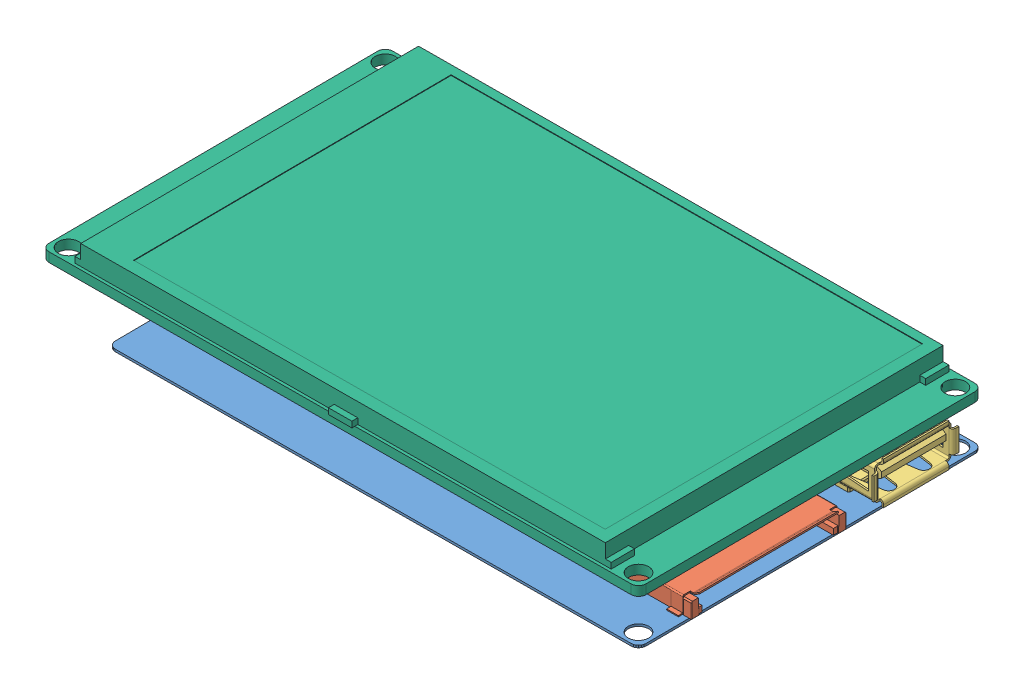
SolidWorks assembly TFT46all.SLDASM, configuration 默认 (file format 9000). Lengths in mm.
Overall size (102.66 13.25 60.6).
11 component instances, 6 part files, 3 mates.
Components (placement in the parent):
- Screen207V1-1: Screen207V1.SLDASM [默认] at (48.8338 -3.3903 98.1373) x (-0.999982 0 0.005983) z (0 1 0) size (91.01 59.02 8.79)
  - Board_1-1: Board_1.sldprt [默认] at (0 0 -0.3912) size (90.02 59.02 0.39)
  - U13-1: U13.sldasm [默认] at origin size (26.36 28.03 4.15)
    - sd_big_1-1: sd_big_1.sldprt [默认] at (-0.3817 37.0464 0) x (0 -1 0) z (-1 0 0) size (28.03 4.15 26.36)
  - U_DISK-1: U_DISK.sldasm [默认] at (0 0 -0.07) size (15.16 17.26 8.79)
    - USBA_1-1: USBA_1.sldprt [默认] at (-1.0035 12.3441 4.2) x (0 -1 0) z (-1 0 0) size (17.26 8.79 15.16)
  - U3-1: U3.sldasm [默认] at origin size (14 14 1.55)
    - 487667936-1: 487667936.sldasm [默认] at (45.941 29.6954 0.05) size (14 14 1.55)
      - Extruded_1-1: Extruded_1.sldprt [默认] at origin size (14 14 1.55)
  - 插座-1: 插座.SLDPRT [默认] at (20.898 11.6917 0) x (1 0.000194 0) z (0.000194 -1 0) size (30 7.2 35.5)
- TFT3.8-1: TFT3.8.SLDPRT [默认] at (-1.6388 3.8097 127.9398) x (0.999982 0 -0.005983) z (0.005983 0 0.999982) size (101.3 5 60)
Mates (geometry in assembly coordinates):
- 重合1: coincident: plane of Screen207V1-1/插座-1 through (28.0061 3.8097 109.9537) normal (0 1 0); plane of TFT3.8-1 through (-1.6388 3.8097 127.9398) normal (0 -1 0)
- 同心1: concentric: cylinder of Screen207V1-1/Board_1-1 through (46.5476 -3.7815 100.451) axis (0 -1 0) radius 1.75; cylinder of TFT3.8-1 through (46.5476 5.4097 100.451) axis (0 -1 0) radius 1.75
- 同心2: concentric aligned: cylinder of Screen207V1-1/Board_1-1 through (46.873 -3.7815 154.85) axis (0 -1 0) radius 1.75; cylinder of TFT3.8-1 through (46.873 5.4097 154.85) axis (0 -1 0) radius 1.75
